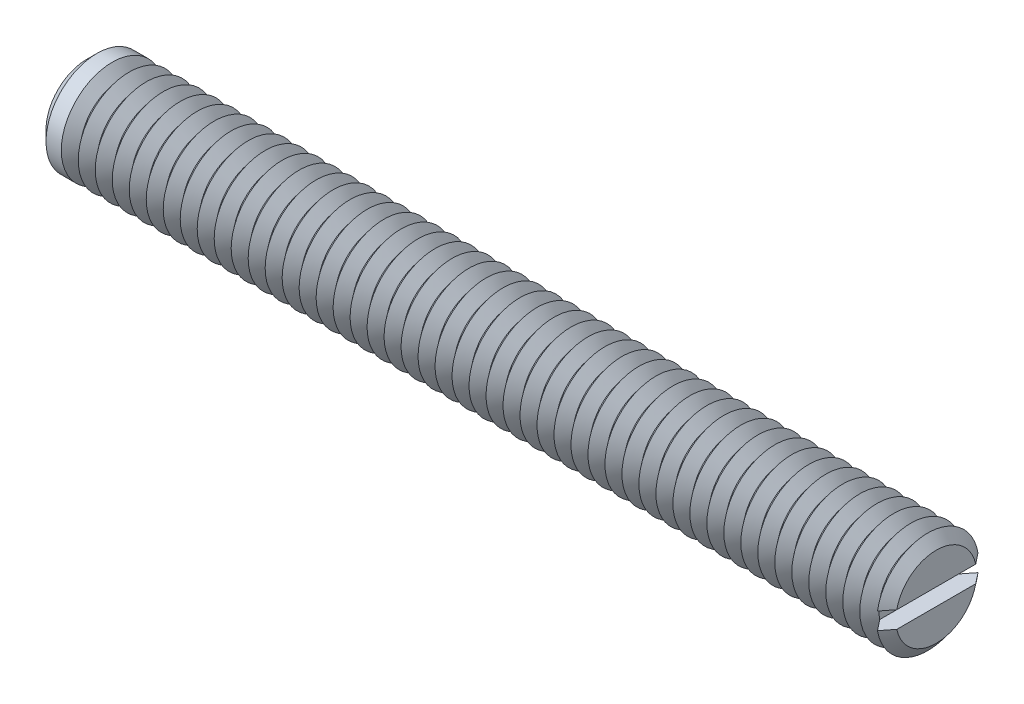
from build123d import *

# Parameters (mm, degrees)
SKETCH1_R       = 3
EXTRUDE1_DEPTH  = 25
SKETCH2_W       = 1
SKETCH2_H       = 1
EXTRUDE2_DEPTH  = 4.5
CHAMFER1_SIZE   = 0.6
LPATTERN1_COUNT = 49
LPATTERN1_PITCH = 1


with BuildPart() as part:
    # Sketch1 → Extrude1 (new, symmetric)
    with BuildSketch(Plane(origin=(0, 0, 0), x_dir=(0, 0, -1), z_dir=(1, 0, 0))):
        Circle(SKETCH1_R)
    extrude(amount=EXTRUDE1_DEPTH, both=True)

    # Sketch2 → Extrude2 (cut, symmetric)
    with BuildSketch(Plane.XY):
        with Locations((24.5, 0)):
            Rectangle(SKETCH2_W, SKETCH2_H)
    extrude(amount=EXTRUDE2_DEPTH, both=True, mode=Mode.SUBTRACT)

    # Chamfer1
    chamfer1_edges = [part.edges().sort_by_distance(p)[0] for p in [
        (-25, 0, 3),
    ]]
    chamfer(chamfer1_edges, length=CHAMFER1_SIZE)

    # Sketch3 → Cut-Revolve1 (revolve, cut)
    with BuildSketch(Plane.XY, mode=Mode.PRIVATE) as cut_revolve1_sk:
        Polygon((24.5, -3), (25.5, -3), (25, -2.3755002), align=None)
    cut_revolve1 = revolve(cut_revolve1_sk.sketch.rotate(Axis((0, 0, 0), (1, 0, 0)), 260.405931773), axis=Axis((0, 0, 0), (1, 0, 0)), mode=Mode.SUBTRACT)

    # LPattern1: Cut-Revolve1 ×49
    with Locations(*[(-i * LPATTERN1_PITCH, 0, 0) for i in range(1, LPATTERN1_COUNT)]):
        add(cut_revolve1, mode=Mode.SUBTRACT)


solid = part.part
